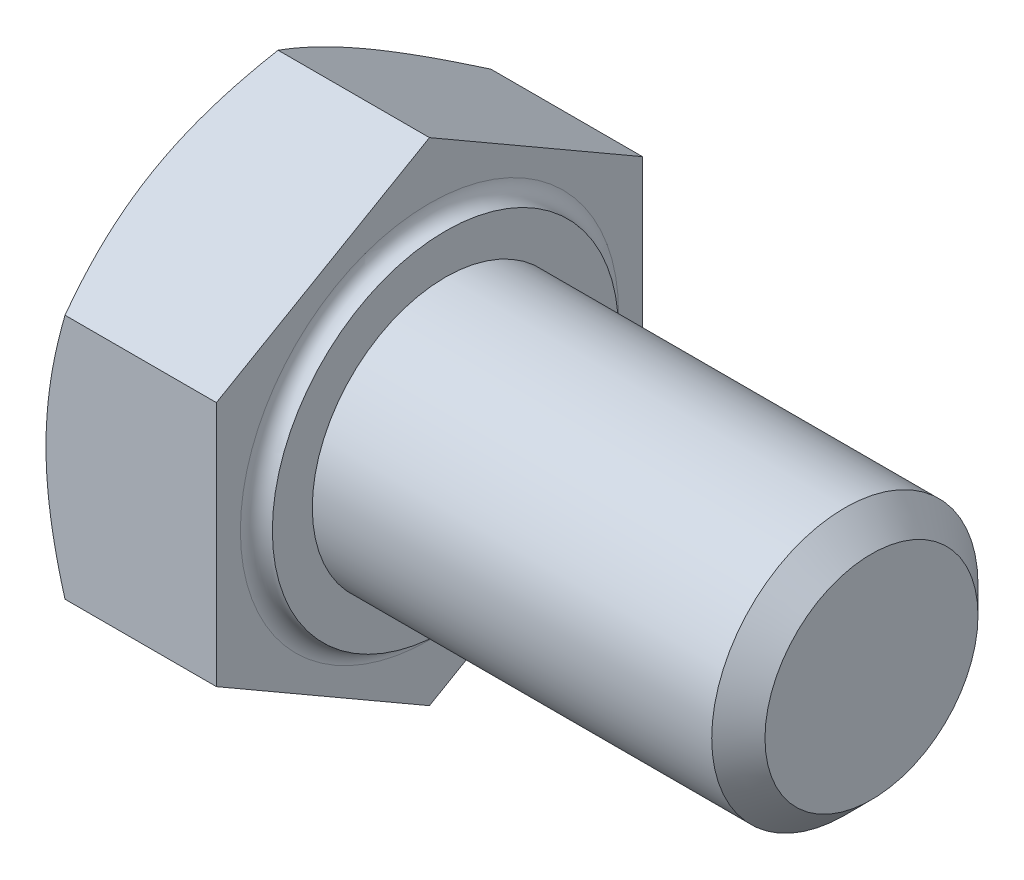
ISO-10303-21;
HEADER;
FILE_DESCRIPTION(('STEP AP214'),'2;1');
FILE_NAME('part.step','',(''),(''),'','','');
FILE_SCHEMA(('AUTOMOTIVE_DESIGN { 1 0 10303 214 1 1 1 1 }'));
ENDSEC;
DATA;
#1=APPLICATION_CONTEXT('core data for automotive mechanical design processes');
#2=APPLICATION_PROTOCOL_DEFINITION('international standard','automotive_design',2000,#1);
#3=PRODUCT_CONTEXT('',#1,'mechanical');
#4=PRODUCT('Part','Part','',(#3));
#5=PRODUCT_RELATED_PRODUCT_CATEGORY('part','',(#4));
#6=PRODUCT_DEFINITION_FORMATION('','',#4);
#7=PRODUCT_DEFINITION_CONTEXT('part definition',#1,'design');
#8=PRODUCT_DEFINITION('design','',#6,#7);
#9=PRODUCT_DEFINITION_SHAPE('','',#8);
#10=(LENGTH_UNIT() NAMED_UNIT(*) SI_UNIT(.MILLI.,.METRE.));
#11=(NAMED_UNIT(*) PLANE_ANGLE_UNIT() SI_UNIT($,.RADIAN.));
#12=(NAMED_UNIT(*) SI_UNIT($,.STERADIAN.) SOLID_ANGLE_UNIT());
#13=UNCERTAINTY_MEASURE_WITH_UNIT(LENGTH_MEASURE(1.E-05),#10,'distance_accuracy_value','');
#14=(GEOMETRIC_REPRESENTATION_CONTEXT(3) GLOBAL_UNCERTAINTY_ASSIGNED_CONTEXT((#13)) GLOBAL_UNIT_ASSIGNED_CONTEXT((#10,
#11,#12)) REPRESENTATION_CONTEXT('',''));
#15=CARTESIAN_POINT('',(0.,0.,0.));
#16=DIRECTION('',(0.,0.,1.));
#17=DIRECTION('',(1.,0.,0.));
#18=AXIS2_PLACEMENT_3D('',#15,#16,#17);
#19=CARTESIAN_POINT('',(-3.5,0.,0.));
#20=DIRECTION('',(-1.,0.,0.));
#21=DIRECTION('',(0.,0.,1.));
#22=AXIS2_PLACEMENT_3D('',#19,#20,#21);
#23=PLANE('',#22);
#24=CARTESIAN_POINT('',(-3.50000000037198,0.,0.));
#25=DIRECTION('',(1.,0.,0.));
#26=DIRECTION('',(0.,0.,-1.));
#27=AXIS2_PLACEMENT_3D('',#24,#25,#26);
#28=CIRCLE('',#27,4.00000000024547);
#29=CARTESIAN_POINT('',(-3.50000000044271,3.46410161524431,2.00000000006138));
#30=VERTEX_POINT('',#29);
#31=CARTESIAN_POINT('',(-3.50000000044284,0.,4.00000000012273));
#32=VERTEX_POINT('',#31);
#33=EDGE_CURVE('E105',#30,#32,#28,.T.);
#34=ORIENTED_EDGE('',*,*,#33,.F.);
#35=CARTESIAN_POINT('',(-3.50000000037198,0.,0.));
#36=DIRECTION('',(1.,0.,0.));
#37=DIRECTION('',(0.,0.,-1.));
#38=AXIS2_PLACEMENT_3D('',#35,#36,#37);
#39=CIRCLE('',#38,4.00000000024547);
#40=CARTESIAN_POINT('',(-3.50000000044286,3.46410161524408,-2.00000000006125));
#41=VERTEX_POINT('',#40);
#42=EDGE_CURVE('E346',#41,#30,#39,.T.);
#43=ORIENTED_EDGE('',*,*,#42,.F.);
#44=CARTESIAN_POINT('',(-3.50000000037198,0.,0.));
#45=DIRECTION('',(1.,0.,0.));
#46=DIRECTION('',(0.,0.,-1.));
#47=AXIS2_PLACEMENT_3D('',#44,#45,#46);
#48=CIRCLE('',#47,4.00000000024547);
#49=CARTESIAN_POINT('',(-3.50000000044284,0.,-4.00000000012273));
#50=VERTEX_POINT('',#49);
#51=EDGE_CURVE('E94',#50,#41,#48,.T.);
#52=ORIENTED_EDGE('',*,*,#51,.F.);
#53=CARTESIAN_POINT('',(-3.50000000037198,0.,0.));
#54=DIRECTION('',(1.,0.,0.));
#55=DIRECTION('',(0.,0.,-1.));
#56=AXIS2_PLACEMENT_3D('',#53,#54,#55);
#57=CIRCLE('',#56,4.00000000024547);
#58=CARTESIAN_POINT('',(-3.50000000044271,-3.46410161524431,-2.00000000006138));
#59=VERTEX_POINT('',#58);
#60=EDGE_CURVE('E89',#59,#50,#57,.T.);
#61=ORIENTED_EDGE('',*,*,#60,.F.);
#62=CARTESIAN_POINT('',(-3.50000000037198,0.,0.));
#63=DIRECTION('',(1.,0.,0.));
#64=DIRECTION('',(0.,0.,-1.));
#65=AXIS2_PLACEMENT_3D('',#62,#63,#64);
#66=CIRCLE('',#65,4.00000000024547);
#67=CARTESIAN_POINT('',(-3.50000000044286,-3.46410161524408,2.00000000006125));
#68=VERTEX_POINT('',#67);
#69=EDGE_CURVE('E87',#68,#59,#66,.T.);
#70=ORIENTED_EDGE('',*,*,#69,.F.);
#71=CARTESIAN_POINT('',(-3.50000000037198,0.,0.));
#72=DIRECTION('',(1.,0.,0.));
#73=DIRECTION('',(0.,0.,-1.));
#74=AXIS2_PLACEMENT_3D('',#71,#72,#73);
#75=CIRCLE('',#74,4.00000000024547);
#76=EDGE_CURVE('E19',#32,#68,#75,.T.);
#77=ORIENTED_EDGE('',*,*,#76,.F.);
#78=EDGE_LOOP('',(#34,#43,#52,#61,#70,#77));
#79=FACE_BOUND('',#78,.T.);
#80=ADVANCED_FACE('F16',(#79),#23,.T.);
#81=CARTESIAN_POINT('',(-3.1405908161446,0.,0.));
#82=DIRECTION('',(1.,0.,0.));
#83=DIRECTION('',(0.,0.,-1.));
#84=AXIS2_PLACEMENT_3D('',#81,#82,#83);
#85=CONICAL_SURFACE('',#84,4.62251496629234,1.04719754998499);
#86=CARTESIAN_POINT('',(-3.14273440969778,-2.30940107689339,3.99999999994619));
#87=CARTESIAN_POINT('',(-3.19701440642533,-2.40339320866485,3.83720085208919));
#88=CARTESIAN_POINT('',(-3.24674436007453,-2.49813806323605,3.6730979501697));
#89=CARTESIAN_POINT('',(-3.3344422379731,-2.68846293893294,3.34344559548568));
#90=CARTESIAN_POINT('',(-3.37246832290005,-2.78403632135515,3.17790764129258));
#91=CARTESIAN_POINT('',(-3.41915789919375,-2.92829837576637,2.92803843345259));
#92=CARTESIAN_POINT('',(-3.43300183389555,-2.97656796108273,2.84443305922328));
#93=CARTESIAN_POINT('',(-3.45696597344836,-3.07333821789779,2.67682205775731));
#94=CARTESIAN_POINT('',(-3.46708627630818,-3.12183888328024,2.59281644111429));
#95=CARTESIAN_POINT('',(-3.48342533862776,-3.21925069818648,2.42409422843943));
#96=CARTESIAN_POINT('',(-3.48962425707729,-3.26816268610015,2.3393761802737));
#97=CARTESIAN_POINT('',(-3.49792016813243,-3.36608285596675,2.16977347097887));
#98=CARTESIAN_POINT('',(-3.5000163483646,-3.4150910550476,2.08488878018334));
#99=CARTESIAN_POINT('',(-3.50000000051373,-3.46410161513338,2.00000000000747));
#100=B_SPLINE_CURVE_WITH_KNOTS('',3,(#86,#87,#88,#89,#90,#91,#92,#93,#94,#95,#96,#97,#98,#99),
.UNSPECIFIED.,.F.,.F.,(4,2,2,2,2,2,4),(0.,0.587229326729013,1.17149154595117,1.46400599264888,
1.7565127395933,2.05048788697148,2.34452123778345),.UNSPECIFIED.);
#101=CARTESIAN_POINT('',(-3.14273440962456,-2.30940107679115,3.99999999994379));
#102=VERTEX_POINT('',#101);
#103=EDGE_CURVE('E100',#102,#68,#100,.T.);
#104=ORIENTED_EDGE('',*,*,#103,.F.);
#105=CARTESIAN_POINT('',(-3.50000000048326,0.,3.99999999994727));
#106=CARTESIAN_POINT('',(-3.50001634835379,-0.0980211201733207,3.99999999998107));
#107=CARTESIAN_POINT('',(-3.49792016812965,-0.196037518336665,3.99999999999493));
#108=CARTESIAN_POINT('',(-3.48962425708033,-0.391877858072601,4.00000000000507));
#109=CARTESIAN_POINT('',(-3.4834253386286,-0.489701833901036,4.00000000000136));
#110=CARTESIAN_POINT('',(-3.46708627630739,-0.684525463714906,3.99999999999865));
#111=CARTESIAN_POINT('',(-3.45696597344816,-0.781526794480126,3.99999999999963));
#112=CARTESIAN_POINT('',(-3.43300183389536,-0.975067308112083,4.00000000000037));
#113=CARTESIAN_POINT('',(-3.41915789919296,-1.07160647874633,4.00000000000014));
#114=CARTESIAN_POINT('',(-3.37246832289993,-1.36013058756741,3.99999999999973));
#115=CARTESIAN_POINT('',(-3.33444223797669,-1.55127735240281,3.99999999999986));
#116=CARTESIAN_POINT('',(-3.24674436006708,-1.93192710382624,4.00000000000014));
#117=CARTESIAN_POINT('',(-3.19701440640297,-2.12141681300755,4.00000000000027));
#118=CARTESIAN_POINT('',(-3.14273440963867,-2.30940107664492,4.));
#119=B_SPLINE_CURVE_WITH_KNOTS('',3,(#105,#106,#107,#108,#109,#110,#111,#112,#113,#114,#115,
#116,#117,#118),.UNSPECIFIED.,.F.,.F.,(4,2,2,2,2,2,4),(0.,0.294033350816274,0.588008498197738,
0.880515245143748,1.1730296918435,1.75729191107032,2.3445212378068),.UNSPECIFIED.);
#120=EDGE_CURVE('E103',#32,#102,#119,.T.);
#121=ORIENTED_EDGE('',*,*,#120,.F.);
#122=ORIENTED_EDGE('',*,*,#76,.T.);
#123=EDGE_LOOP('',(#104,#121,#122));
#124=FACE_BOUND('',#123,.T.);
#125=ADVANCED_FACE('F98',(#124),#85,.T.);
#126=CARTESIAN_POINT('',(-3.1405908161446,0.,0.));
#127=DIRECTION('',(1.,0.,0.));
#128=DIRECTION('',(0.,0.,-1.));
#129=AXIS2_PLACEMENT_3D('',#126,#127,#128);
#130=CONICAL_SURFACE('',#129,4.62251496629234,1.04719754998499);
#131=CARTESIAN_POINT('',(-3.14273440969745,2.3094010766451,4.00000000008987));
#132=CARTESIAN_POINT('',(-3.19701440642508,2.12141681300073,4.00000000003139));
#133=CARTESIAN_POINT('',(-3.24674436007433,1.93192710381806,4.0000000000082));
#134=CARTESIAN_POINT('',(-3.33444223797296,1.55127735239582,3.99999999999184));
#135=CARTESIAN_POINT('',(-3.37246832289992,1.36013058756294,3.9999999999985));
#136=CARTESIAN_POINT('',(-3.41915789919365,1.07160647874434,4.00000000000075));
#137=CARTESIAN_POINT('',(-3.43300183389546,0.975067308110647,4.0000000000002));
#138=CARTESIAN_POINT('',(-3.45696597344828,0.781526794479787,3.9999999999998));
#139=CARTESIAN_POINT('',(-3.46708627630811,0.684525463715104,3.99999999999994));
#140=CARTESIAN_POINT('',(-3.48342533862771,0.489701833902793,4.00000000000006));
#141=CARTESIAN_POINT('',(-3.48962425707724,0.391877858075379,4.00000000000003));
#142=CARTESIAN_POINT('',(-3.49792016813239,0.196037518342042,3.99999999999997));
#143=CARTESIAN_POINT('',(-3.50001634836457,0.0980211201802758,3.99999999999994));
#144=CARTESIAN_POINT('',(-3.5000000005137,8.78869142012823E-12,4.));
#145=B_SPLINE_CURVE_WITH_KNOTS('',3,(#131,#132,#133,#134,#135,#136,#137,#138,#139,#140,#141,
#142,#143,#144),.UNSPECIFIED.,.F.,.F.,(4,2,2,2,2,2,4),(0.,0.58722932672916,1.17149154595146,
1.46400599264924,1.75651273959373,2.05048788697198,2.34452123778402),.UNSPECIFIED.);
#146=CARTESIAN_POINT('',(-3.14273440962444,2.30940107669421,4.));
#147=VERTEX_POINT('',#146);
#148=EDGE_CURVE('E112',#147,#32,#145,.T.);
#149=ORIENTED_EDGE('',*,*,#148,.F.);
#150=CARTESIAN_POINT('',(-3.50000000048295,3.46410161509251,1.99999999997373));
#151=CARTESIAN_POINT('',(-3.5000163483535,3.41509105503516,2.08488878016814));
#152=CARTESIAN_POINT('',(-3.49792016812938,3.36608285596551,2.16977347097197));
#153=CARTESIAN_POINT('',(-3.48962425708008,3.26816268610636,2.3393761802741));
#154=CARTESIAN_POINT('',(-3.48342533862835,3.21925069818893,2.42409422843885));
#155=CARTESIAN_POINT('',(-3.46708627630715,3.12183888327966,2.59281644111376));
#156=CARTESIAN_POINT('',(-3.45696597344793,3.07333821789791,2.67682205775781));
#157=CARTESIAN_POINT('',(-3.43300183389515,2.97656796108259,2.84443305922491));
#158=CARTESIAN_POINT('',(-3.41915789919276,2.92829837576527,2.92803843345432));
#159=CARTESIAN_POINT('',(-3.37246832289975,2.7840363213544,3.17790764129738));
#160=CARTESIAN_POINT('',(-3.33444223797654,2.68846293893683,3.34344559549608));
#161=CARTESIAN_POINT('',(-3.24674436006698,2.49813806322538,3.67309795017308));
#162=CARTESIAN_POINT('',(-3.19701440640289,2.40339320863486,3.83720085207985));
#163=CARTESIAN_POINT('',(-3.14273440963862,2.30940107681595,3.99999999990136));
#164=B_SPLINE_CURVE_WITH_KNOTS('',3,(#150,#151,#152,#153,#154,#155,#156,#157,#158,#159,#160,
#161,#162,#163),.UNSPECIFIED.,.F.,.F.,(4,2,2,2,2,2,4),(0.,0.294033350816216,0.588008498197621,
0.880515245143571,1.17302969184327,1.75729191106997,2.34452123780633),.UNSPECIFIED.);
#165=EDGE_CURVE('E166',#30,#147,#164,.T.);
#166=ORIENTED_EDGE('',*,*,#165,.F.);
#167=ORIENTED_EDGE('',*,*,#33,.T.);
#168=EDGE_LOOP('',(#149,#166,#167));
#169=FACE_BOUND('',#168,.T.);
#170=ADVANCED_FACE('F134',(#169),#130,.T.);
#171=CARTESIAN_POINT('',(-3.1405908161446,0.,0.));
#172=DIRECTION('',(1.,0.,0.));
#173=DIRECTION('',(0.,0.,-1.));
#174=AXIS2_PLACEMENT_3D('',#171,#172,#173);
#175=CONICAL_SURFACE('',#174,4.62251496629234,1.04719754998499);
#176=CARTESIAN_POINT('',(-3.14273440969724,4.61880215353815,1.4379973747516E-10));
#177=CARTESIAN_POINT('',(-3.19701440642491,4.52481002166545,0.162799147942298));
#178=CARTESIAN_POINT('',(-3.24674436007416,4.43006516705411,0.326902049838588));
#179=CARTESIAN_POINT('',(-3.33444223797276,4.23974029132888,0.656554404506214));
#180=CARTESIAN_POINT('',(-3.3724683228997,4.14416690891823,0.822092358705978));
#181=CARTESIAN_POINT('',(-3.4191578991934,3.99990485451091,1.0719615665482));
#182=CARTESIAN_POINT('',(-3.43300183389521,3.9516352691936,1.15556694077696));
#183=CARTESIAN_POINT('',(-3.45696597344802,3.85486501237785,1.32317794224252));
#184=CARTESIAN_POINT('',(-3.46708627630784,3.80636434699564,1.40718355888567));
#185=CARTESIAN_POINT('',(-3.48342533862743,3.70895253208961,1.57590577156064));
#186=CARTESIAN_POINT('',(-3.48962425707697,3.6600405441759,1.66062381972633));
#187=CARTESIAN_POINT('',(-3.49792016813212,3.5621203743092,1.83022652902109));
#188=CARTESIAN_POINT('',(-3.50001634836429,3.51311217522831,1.91511121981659));
#189=CARTESIAN_POINT('',(-3.50000000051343,3.46410161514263,1.99999999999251));
#190=B_SPLINE_CURVE_WITH_KNOTS('',3,(#176,#177,#178,#179,#180,#181,#182,#183,#184,#185,#186,
#187,#188,#189),.UNSPECIFIED.,.F.,.F.,(4,2,2,2,2,2,4),(0.,0.58722932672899,1.17149154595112,
1.46400599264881,1.75651273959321,2.05048788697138,2.34452123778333),.UNSPECIFIED.);
#191=CARTESIAN_POINT('',(-3.14273440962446,4.61880215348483,5.62523670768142E-11));
#192=VERTEX_POINT('',#191);
#193=EDGE_CURVE('E143',#192,#30,#190,.T.);
#194=ORIENTED_EDGE('',*,*,#193,.F.);
#195=CARTESIAN_POINT('',(-3.50000000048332,3.46410161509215,-1.99999999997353));
#196=CARTESIAN_POINT('',(-3.50001634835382,3.51311217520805,-1.91511121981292));
#197=CARTESIAN_POINT('',(-3.49792016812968,3.56212037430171,-1.83022652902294));
#198=CARTESIAN_POINT('',(-3.48962425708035,3.66004054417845,-1.66062381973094));
#199=CARTESIAN_POINT('',(-3.48342533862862,3.70895253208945,-1.57590577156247));
#200=CARTESIAN_POINT('',(-3.46708627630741,3.80636434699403,-1.40718355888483));
#201=CARTESIAN_POINT('',(-3.45696597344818,3.85486501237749,-1.32317794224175));
#202=CARTESIAN_POINT('',(-3.43300183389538,3.9516352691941,-1.15556694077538));
#203=CARTESIAN_POINT('',(-3.41915789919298,3.99990485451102,-1.07196156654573));
#204=CARTESIAN_POINT('',(-3.37246832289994,4.1441669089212,-0.822092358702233));
#205=CARTESIAN_POINT('',(-3.33444223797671,4.23974029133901,-0.656554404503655));
#206=CARTESIAN_POINT('',(-3.2467443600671,4.43006516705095,-0.326902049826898));
#207=CARTESIAN_POINT('',(-3.197014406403,4.52481002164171,-0.16279914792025));
#208=CARTESIAN_POINT('',(-3.1427344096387,4.61880215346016,-9.84525494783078E-11));
#209=B_SPLINE_CURVE_WITH_KNOTS('',3,(#195,#196,#197,#198,#199,#200,#201,#202,#203,#204,#205,
#206,#207,#208),.UNSPECIFIED.,.F.,.F.,(4,2,2,2,2,2,4),(0.,0.294033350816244,0.588008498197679,
0.88051524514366,1.17302969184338,1.75729191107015,2.34452123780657),.UNSPECIFIED.);
#210=EDGE_CURVE('E180',#41,#192,#209,.T.);
#211=ORIENTED_EDGE('',*,*,#210,.F.);
#212=ORIENTED_EDGE('',*,*,#42,.T.);
#213=EDGE_LOOP('',(#194,#211,#212));
#214=FACE_BOUND('',#213,.T.);
#215=ADVANCED_FACE('F188',(#214),#175,.T.);
#216=CARTESIAN_POINT('',(-3.1405908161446,0.,0.));
#217=DIRECTION('',(1.,0.,0.));
#218=DIRECTION('',(0.,0.,-1.));
#219=AXIS2_PLACEMENT_3D('',#216,#217,#218);
#220=CONICAL_SURFACE('',#219,4.62251496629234,1.04719754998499);
#221=CARTESIAN_POINT('',(-3.14273440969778,2.3094010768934,-3.99999999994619));
#222=CARTESIAN_POINT('',(-3.19701440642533,2.40339320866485,-3.83720085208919));
#223=CARTESIAN_POINT('',(-3.24674436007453,2.49813806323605,-3.6730979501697));
#224=CARTESIAN_POINT('',(-3.3344422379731,2.68846293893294,-3.34344559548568));
#225=CARTESIAN_POINT('',(-3.37246832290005,2.78403632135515,-3.17790764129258));
#226=CARTESIAN_POINT('',(-3.41915789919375,2.92829837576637,-2.92803843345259));
#227=CARTESIAN_POINT('',(-3.43300183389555,2.97656796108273,-2.84443305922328));
#228=CARTESIAN_POINT('',(-3.45696597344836,3.07333821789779,-2.67682205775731));
#229=CARTESIAN_POINT('',(-3.46708627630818,3.12183888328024,-2.59281644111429));
#230=CARTESIAN_POINT('',(-3.48342533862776,3.21925069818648,-2.42409422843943));
#231=CARTESIAN_POINT('',(-3.48962425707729,3.26816268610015,-2.3393761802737));
#232=CARTESIAN_POINT('',(-3.49792016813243,3.36608285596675,-2.16977347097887));
#233=CARTESIAN_POINT('',(-3.5000163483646,3.4150910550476,-2.08488878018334));
#234=CARTESIAN_POINT('',(-3.50000000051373,3.46410161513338,-2.00000000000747));
#235=B_SPLINE_CURVE_WITH_KNOTS('',3,(#221,#222,#223,#224,#225,#226,#227,#228,#229,#230,#231,
#232,#233,#234),.UNSPECIFIED.,.F.,.F.,(4,2,2,2,2,2,4),(0.,0.587229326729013,1.17149154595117,
1.46400599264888,1.7565127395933,2.05048788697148,2.34452123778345),.UNSPECIFIED.);
#236=CARTESIAN_POINT('',(-3.14273440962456,2.30940107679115,-3.99999999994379));
#237=VERTEX_POINT('',#236);
#238=EDGE_CURVE('E173',#237,#41,#235,.T.);
#239=ORIENTED_EDGE('',*,*,#238,.F.);
#240=CARTESIAN_POINT('',(-3.50000000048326,0.,-3.99999999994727));
#241=CARTESIAN_POINT('',(-3.50001634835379,0.0980211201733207,-3.99999999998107));
#242=CARTESIAN_POINT('',(-3.49792016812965,0.196037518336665,-3.99999999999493));
#243=CARTESIAN_POINT('',(-3.48962425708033,0.391877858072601,-4.00000000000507));
#244=CARTESIAN_POINT('',(-3.4834253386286,0.489701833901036,-4.00000000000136));
#245=CARTESIAN_POINT('',(-3.46708627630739,0.684525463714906,-3.99999999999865));
#246=CARTESIAN_POINT('',(-3.45696597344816,0.781526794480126,-3.99999999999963));
#247=CARTESIAN_POINT('',(-3.43300183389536,0.975067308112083,-4.00000000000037));
#248=CARTESIAN_POINT('',(-3.41915789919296,1.07160647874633,-4.00000000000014));
#249=CARTESIAN_POINT('',(-3.37246832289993,1.36013058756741,-3.99999999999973));
#250=CARTESIAN_POINT('',(-3.33444223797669,1.55127735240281,-3.99999999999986));
#251=CARTESIAN_POINT('',(-3.24674436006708,1.93192710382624,-4.00000000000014));
#252=CARTESIAN_POINT('',(-3.19701440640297,2.12141681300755,-4.00000000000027));
#253=CARTESIAN_POINT('',(-3.14273440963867,2.30940107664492,-4.));
#254=B_SPLINE_CURVE_WITH_KNOTS('',3,(#240,#241,#242,#243,#244,#245,#246,#247,#248,#249,#250,
#251,#252,#253),.UNSPECIFIED.,.F.,.F.,(4,2,2,2,2,2,4),(0.,0.294033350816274,0.588008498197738,
0.880515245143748,1.1730296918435,1.75729191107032,2.3445212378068),.UNSPECIFIED.);
#255=EDGE_CURVE('E194',#50,#237,#254,.T.);
#256=ORIENTED_EDGE('',*,*,#255,.F.);
#257=ORIENTED_EDGE('',*,*,#51,.T.);
#258=EDGE_LOOP('',(#239,#256,#257));
#259=FACE_BOUND('',#258,.T.);
#260=ADVANCED_FACE('F185',(#259),#220,.T.);
#261=CARTESIAN_POINT('',(-3.1405908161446,0.,0.));
#262=DIRECTION('',(1.,0.,0.));
#263=DIRECTION('',(0.,0.,-1.));
#264=AXIS2_PLACEMENT_3D('',#261,#262,#263);
#265=CONICAL_SURFACE('',#264,4.62251496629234,1.04719754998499);
#266=CARTESIAN_POINT('',(-3.14273440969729,-4.61880215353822,-1.43825530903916E-10));
#267=CARTESIAN_POINT('',(-3.19701440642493,-4.52481002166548,-0.162799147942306));
#268=CARTESIAN_POINT('',(-3.24674436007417,-4.43006516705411,-0.326902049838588));
#269=CARTESIAN_POINT('',(-3.33444223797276,-4.23974029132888,-0.656554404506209));
#270=CARTESIAN_POINT('',(-3.3724683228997,-4.14416690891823,-0.822092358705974));
#271=CARTESIAN_POINT('',(-3.4191578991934,-3.99990485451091,-1.0719615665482));
#272=CARTESIAN_POINT('',(-3.43300183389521,-3.9516352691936,-1.15556694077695));
#273=CARTESIAN_POINT('',(-3.45696597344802,-3.85486501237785,-1.32317794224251));
#274=CARTESIAN_POINT('',(-3.46708627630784,-3.80636434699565,-1.40718355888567));
#275=CARTESIAN_POINT('',(-3.48342533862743,-3.70895253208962,-1.57590577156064));
#276=CARTESIAN_POINT('',(-3.48962425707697,-3.6600405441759,-1.66062381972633));
#277=CARTESIAN_POINT('',(-3.49792016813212,-3.5621203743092,-1.83022652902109));
#278=CARTESIAN_POINT('',(-3.50001634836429,-3.51311217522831,-1.91511121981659));
#279=CARTESIAN_POINT('',(-3.50000000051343,-3.46410161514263,-1.99999999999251));
#280=B_SPLINE_CURVE_WITH_KNOTS('',3,(#266,#267,#268,#269,#270,#271,#272,#273,#274,#275,#276,
#277,#278,#279),.UNSPECIFIED.,.F.,.F.,(4,2,2,2,2,2,4),(0.,0.587229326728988,1.17149154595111,
1.46400599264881,1.75651273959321,2.05048788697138,2.34452123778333),.UNSPECIFIED.);
#281=CARTESIAN_POINT('',(-3.14273440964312,-4.61880215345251,-2.70863802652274E-13));
#282=VERTEX_POINT('',#281);
#283=EDGE_CURVE('E109',#282,#59,#280,.T.);
#284=ORIENTED_EDGE('',*,*,#283,.F.);
#285=CARTESIAN_POINT('',(-3.50000000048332,-3.46410161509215,1.99999999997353));
#286=CARTESIAN_POINT('',(-3.50001634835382,-3.51311217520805,1.91511121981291));
#287=CARTESIAN_POINT('',(-3.49792016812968,-3.56212037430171,1.83022652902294));
#288=CARTESIAN_POINT('',(-3.48962425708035,-3.66004054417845,1.66062381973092));
#289=CARTESIAN_POINT('',(-3.48342533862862,-3.70895253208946,1.57590577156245));
#290=CARTESIAN_POINT('',(-3.46708627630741,-3.80636434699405,1.4071835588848));
#291=CARTESIAN_POINT('',(-3.45696597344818,-3.8548650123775,1.32317794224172));
#292=CARTESIAN_POINT('',(-3.43300183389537,-3.95163526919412,1.15556694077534));
#293=CARTESIAN_POINT('',(-3.41915789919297,-3.99990485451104,1.07196156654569));
#294=CARTESIAN_POINT('',(-3.37246832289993,-4.14416690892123,0.822092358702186));
#295=CARTESIAN_POINT('',(-3.3344422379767,-4.23974029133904,0.6565544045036));
#296=CARTESIAN_POINT('',(-3.24674436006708,-4.43006516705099,0.326902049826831));
#297=CARTESIAN_POINT('',(-3.19701440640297,-4.52481002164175,0.162799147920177));
#298=CARTESIAN_POINT('',(-3.14273440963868,-4.6188021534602,9.83725469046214E-11));
#299=B_SPLINE_CURVE_WITH_KNOTS('',3,(#285,#286,#287,#288,#289,#290,#291,#292,#293,#294,#295,
#296,#297,#298),.UNSPECIFIED.,.F.,.F.,(4,2,2,2,2,2,4),(0.,0.294033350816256,0.588008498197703,
0.880515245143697,1.17302969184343,1.75729191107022,2.34452123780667),.UNSPECIFIED.);
#300=EDGE_CURVE('E106',#68,#282,#299,.T.);
#301=ORIENTED_EDGE('',*,*,#300,.F.);
#302=ORIENTED_EDGE('',*,*,#69,.T.);
#303=EDGE_LOOP('',(#284,#301,#302));
#304=FACE_BOUND('',#303,.T.);
#305=ADVANCED_FACE('F107',(#304),#265,.T.);
#306=CARTESIAN_POINT('',(-3.1405908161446,0.,0.));
#307=DIRECTION('',(1.,0.,0.));
#308=DIRECTION('',(0.,0.,-1.));
#309=AXIS2_PLACEMENT_3D('',#306,#307,#308);
#310=CONICAL_SURFACE('',#309,4.62251496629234,1.04719754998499);
#311=CARTESIAN_POINT('',(-3.14273440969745,-2.3094010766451,-4.00000000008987));
#312=CARTESIAN_POINT('',(-3.19701440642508,-2.12141681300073,-4.00000000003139));
#313=CARTESIAN_POINT('',(-3.24674436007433,-1.93192710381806,-4.0000000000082));
#314=CARTESIAN_POINT('',(-3.33444223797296,-1.55127735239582,-3.99999999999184));
#315=CARTESIAN_POINT('',(-3.37246832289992,-1.36013058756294,-3.9999999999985));
#316=CARTESIAN_POINT('',(-3.41915789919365,-1.07160647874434,-4.00000000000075));
#317=CARTESIAN_POINT('',(-3.43300183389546,-0.975067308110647,-4.0000000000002));
#318=CARTESIAN_POINT('',(-3.45696597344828,-0.781526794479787,-3.9999999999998));
#319=CARTESIAN_POINT('',(-3.46708627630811,-0.684525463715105,-3.99999999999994));
#320=CARTESIAN_POINT('',(-3.48342533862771,-0.489701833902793,-4.00000000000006));
#321=CARTESIAN_POINT('',(-3.48962425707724,-0.391877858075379,-4.00000000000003));
#322=CARTESIAN_POINT('',(-3.49792016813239,-0.196037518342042,-3.99999999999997));
#323=CARTESIAN_POINT('',(-3.50001634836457,-0.0980211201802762,-3.99999999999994));
#324=CARTESIAN_POINT('',(-3.5000000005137,-8.78892628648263E-12,-4.));
#325=B_SPLINE_CURVE_WITH_KNOTS('',3,(#311,#312,#313,#314,#315,#316,#317,#318,#319,#320,#321,
#322,#323,#324),.UNSPECIFIED.,.F.,.F.,(4,2,2,2,2,2,4),(0.,0.58722932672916,1.17149154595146,
1.46400599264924,1.75651273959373,2.05048788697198,2.34452123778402),.UNSPECIFIED.);
#326=CARTESIAN_POINT('',(-3.14273440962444,-2.30940107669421,-4.));
#327=VERTEX_POINT('',#326);
#328=EDGE_CURVE('E201',#327,#50,#325,.T.);
#329=ORIENTED_EDGE('',*,*,#328,.F.);
#330=CARTESIAN_POINT('',(-3.50000000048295,-3.46410161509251,-1.99999999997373));
#331=CARTESIAN_POINT('',(-3.5000163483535,-3.41509105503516,-2.08488878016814));
#332=CARTESIAN_POINT('',(-3.49792016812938,-3.36608285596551,-2.16977347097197));
#333=CARTESIAN_POINT('',(-3.48962425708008,-3.26816268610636,-2.3393761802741));
#334=CARTESIAN_POINT('',(-3.48342533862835,-3.21925069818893,-2.42409422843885));
#335=CARTESIAN_POINT('',(-3.46708627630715,-3.12183888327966,-2.59281644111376));
#336=CARTESIAN_POINT('',(-3.45696597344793,-3.07333821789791,-2.67682205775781));
#337=CARTESIAN_POINT('',(-3.43300183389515,-2.97656796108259,-2.84443305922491));
#338=CARTESIAN_POINT('',(-3.41915789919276,-2.92829837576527,-2.92803843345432));
#339=CARTESIAN_POINT('',(-3.37246832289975,-2.7840363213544,-3.17790764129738));
#340=CARTESIAN_POINT('',(-3.33444223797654,-2.68846293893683,-3.34344559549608));
#341=CARTESIAN_POINT('',(-3.24674436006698,-2.49813806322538,-3.67309795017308));
#342=CARTESIAN_POINT('',(-3.19701440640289,-2.40339320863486,-3.83720085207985));
#343=CARTESIAN_POINT('',(-3.14273440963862,-2.30940107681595,-3.99999999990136));
#344=B_SPLINE_CURVE_WITH_KNOTS('',3,(#330,#331,#332,#333,#334,#335,#336,#337,#338,#339,#340,
#341,#342,#343),.UNSPECIFIED.,.F.,.F.,(4,2,2,2,2,2,4),(0.,0.294033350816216,0.588008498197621,
0.880515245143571,1.17302969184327,1.75729191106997,2.34452123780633),.UNSPECIFIED.);
#345=EDGE_CURVE('E223',#59,#327,#344,.T.);
#346=ORIENTED_EDGE('',*,*,#345,.F.);
#347=ORIENTED_EDGE('',*,*,#60,.T.);
#348=EDGE_LOOP('',(#329,#346,#347));
#349=FACE_BOUND('',#348,.T.);
#350=ADVANCED_FACE('F232',(#349),#310,.T.);
#351=CARTESIAN_POINT('',(0.,-4.618802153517,0.));
#352=DIRECTION('',(0.,-0.866025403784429,0.500000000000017));
#353=DIRECTION('',(0.,-0.500000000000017,-0.866025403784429));
#354=AXIS2_PLACEMENT_3D('',#351,#352,#353);
#355=PLANE('',#354);
#356=ORIENTED_EDGE('',*,*,#300,.T.);
#357=DIRECTION('',(1.,0.,0.));
#358=VECTOR('',#357,1.);
#359=CARTESIAN_POINT('',(0.,-4.61880215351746,-2.62810606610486E-13));
#360=LINE('',#359,#358);
#361=CARTESIAN_POINT('',(-0.3,-4.61880215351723,-1.3162214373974E-13));
#362=VERTEX_POINT('',#361);
#363=EDGE_CURVE('E296',#362,#282,#360,.F.);
#364=ORIENTED_EDGE('',*,*,#363,.F.);
#365=DIRECTION('',(0.,0.499999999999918,0.866025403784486));
#366=VECTOR('',#365,1.);
#367=CARTESIAN_POINT('',(-0.3,-4.618802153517,0.));
#368=LINE('',#367,#366);
#369=CARTESIAN_POINT('',(-0.3,-2.30940107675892,4.));
#370=VERTEX_POINT('',#369);
#371=EDGE_CURVE('E295',#362,#370,#368,.T.);
#372=ORIENTED_EDGE('',*,*,#371,.T.);
#373=DIRECTION('',(1.,0.,0.));
#374=VECTOR('',#373,1.);
#375=CARTESIAN_POINT('',(0.,-2.309401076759,4.));
#376=LINE('',#375,#374);
#377=EDGE_CURVE('E116',#102,#370,#376,.T.);
#378=ORIENTED_EDGE('',*,*,#377,.F.);
#379=ORIENTED_EDGE('',*,*,#103,.T.);
#380=EDGE_LOOP('',(#356,#364,#372,#378,#379));
#381=FACE_BOUND('',#380,.T.);
#382=ADVANCED_FACE('F114',(#381),#355,.T.);
#383=CARTESIAN_POINT('',(0.,-2.309401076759,4.));
#384=DIRECTION('',(0.,0.,1.));
#385=DIRECTION('',(1.,0.,0.));
#386=AXIS2_PLACEMENT_3D('',#383,#384,#385);
#387=PLANE('',#386);
#388=ORIENTED_EDGE('',*,*,#120,.T.);
#389=ORIENTED_EDGE('',*,*,#377,.T.);
#390=DIRECTION('',(0.,1.,0.));
#391=VECTOR('',#390,1.);
#392=CARTESIAN_POINT('',(-0.3,0.,4.));
#393=LINE('',#392,#391);
#394=CARTESIAN_POINT('',(-0.3,2.309401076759,4.));
#395=VERTEX_POINT('',#394);
#396=EDGE_CURVE('E311',#370,#395,#393,.T.);
#397=ORIENTED_EDGE('',*,*,#396,.T.);
#398=DIRECTION('',(1.,0.,0.));
#399=VECTOR('',#398,1.);
#400=CARTESIAN_POINT('',(0.,2.309401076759,4.));
#401=LINE('',#400,#399);
#402=EDGE_CURVE('E172',#147,#395,#401,.T.);
#403=ORIENTED_EDGE('',*,*,#402,.F.);
#404=ORIENTED_EDGE('',*,*,#148,.T.);
#405=EDGE_LOOP('',(#388,#389,#397,#403,#404));
#406=FACE_BOUND('',#405,.T.);
#407=ADVANCED_FACE('F152',(#406),#387,.T.);
#408=CARTESIAN_POINT('',(0.,2.309401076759,4.));
#409=DIRECTION('',(0.,0.866025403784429,0.500000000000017));
#410=DIRECTION('',(0.,-0.500000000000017,0.866025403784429));
#411=AXIS2_PLACEMENT_3D('',#408,#409,#410);
#412=PLANE('',#411);
#413=ORIENTED_EDGE('',*,*,#165,.T.);
#414=ORIENTED_EDGE('',*,*,#402,.T.);
#415=DIRECTION('',(0.,0.499999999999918,-0.866025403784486));
#416=VECTOR('',#415,1.);
#417=CARTESIAN_POINT('',(-0.3,2.309401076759,4.));
#418=LINE('',#417,#416);
#419=CARTESIAN_POINT('',(-0.3,4.61880215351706,0.));
#420=VERTEX_POINT('',#419);
#421=EDGE_CURVE('E313',#395,#420,#418,.T.);
#422=ORIENTED_EDGE('',*,*,#421,.T.);
#423=DIRECTION('',(1.,0.,0.));
#424=VECTOR('',#423,1.);
#425=CARTESIAN_POINT('',(0.,4.618802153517,0.));
#426=LINE('',#425,#424);
#427=EDGE_CURVE('E299',#192,#420,#426,.T.);
#428=ORIENTED_EDGE('',*,*,#427,.F.);
#429=ORIENTED_EDGE('',*,*,#193,.T.);
#430=EDGE_LOOP('',(#413,#414,#422,#428,#429));
#431=FACE_BOUND('',#430,.T.);
#432=ADVANCED_FACE('F155',(#431),#412,.T.);
#433=CARTESIAN_POINT('',(0.,4.618802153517,0.));
#434=DIRECTION('',(0.,0.866025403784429,-0.500000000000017));
#435=DIRECTION('',(0.,0.500000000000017,0.866025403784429));
#436=AXIS2_PLACEMENT_3D('',#433,#434,#435);
#437=PLANE('',#436);
#438=ORIENTED_EDGE('',*,*,#210,.T.);
#439=ORIENTED_EDGE('',*,*,#427,.T.);
#440=DIRECTION('',(0.,-0.499999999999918,-0.866025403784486));
#441=VECTOR('',#440,1.);
#442=CARTESIAN_POINT('',(-0.3,4.618802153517,0.));
#443=LINE('',#442,#441);
#444=CARTESIAN_POINT('',(-0.3,2.30940107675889,-4.));
#445=VERTEX_POINT('',#444);
#446=EDGE_CURVE('E307',#420,#445,#443,.T.);
#447=ORIENTED_EDGE('',*,*,#446,.T.);
#448=DIRECTION('',(-1.,0.,0.));
#449=VECTOR('',#448,1.);
#450=CARTESIAN_POINT('',(0.,2.309401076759,-4.));
#451=LINE('',#450,#449);
#452=EDGE_CURVE('E200',#237,#445,#451,.F.);
#453=ORIENTED_EDGE('',*,*,#452,.F.);
#454=ORIENTED_EDGE('',*,*,#238,.T.);
#455=EDGE_LOOP('',(#438,#439,#447,#453,#454));
#456=FACE_BOUND('',#455,.T.);
#457=ADVANCED_FACE('F161',(#456),#437,.T.);
#458=CARTESIAN_POINT('',(0.,2.309401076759,-4.));
#459=DIRECTION('',(0.,0.,-1.));
#460=DIRECTION('',(-1.,0.,0.));
#461=AXIS2_PLACEMENT_3D('',#458,#459,#460);
#462=PLANE('',#461);
#463=ORIENTED_EDGE('',*,*,#255,.T.);
#464=ORIENTED_EDGE('',*,*,#452,.T.);
#465=DIRECTION('',(0.,1.,0.));
#466=VECTOR('',#465,1.);
#467=CARTESIAN_POINT('',(-0.3,0.,-4.));
#468=LINE('',#467,#466);
#469=CARTESIAN_POINT('',(-0.3,-2.309401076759,-4.));
#470=VERTEX_POINT('',#469);
#471=EDGE_CURVE('E34',#445,#470,#468,.F.);
#472=ORIENTED_EDGE('',*,*,#471,.T.);
#473=DIRECTION('',(1.,0.,0.));
#474=VECTOR('',#473,1.);
#475=CARTESIAN_POINT('',(0.,-2.309401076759,-4.));
#476=LINE('',#475,#474);
#477=EDGE_CURVE('E229',#327,#470,#476,.T.);
#478=ORIENTED_EDGE('',*,*,#477,.F.);
#479=ORIENTED_EDGE('',*,*,#328,.T.);
#480=EDGE_LOOP('',(#463,#464,#472,#478,#479));
#481=FACE_BOUND('',#480,.T.);
#482=ADVANCED_FACE('F210',(#481),#462,.T.);
#483=CARTESIAN_POINT('',(0.,-2.309401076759,-4.));
#484=DIRECTION('',(0.,-0.866025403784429,-0.500000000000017));
#485=DIRECTION('',(0.,0.500000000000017,-0.866025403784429));
#486=AXIS2_PLACEMENT_3D('',#483,#484,#485);
#487=PLANE('',#486);
#488=ORIENTED_EDGE('',*,*,#345,.T.);
#489=ORIENTED_EDGE('',*,*,#477,.T.);
#490=DIRECTION('',(0.,-0.499999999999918,0.866025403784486));
#491=VECTOR('',#490,1.);
#492=CARTESIAN_POINT('',(-0.3,-2.309401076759,-4.));
#493=LINE('',#492,#491);
#494=EDGE_CURVE('E306',#470,#362,#493,.T.);
#495=ORIENTED_EDGE('',*,*,#494,.T.);
#496=ORIENTED_EDGE('',*,*,#363,.T.);
#497=ORIENTED_EDGE('',*,*,#283,.T.);
#498=EDGE_LOOP('',(#488,#489,#495,#496,#497));
#499=FACE_BOUND('',#498,.T.);
#500=ADVANCED_FACE('F213',(#499),#487,.T.);
#501=CARTESIAN_POINT('',(-0.3,0.,0.));
#502=DIRECTION('',(-1.,0.,0.));
#503=DIRECTION('',(0.,0.,1.));
#504=AXIS2_PLACEMENT_3D('',#501,#502,#503);
#505=PLANE('',#504);
#506=CARTESIAN_POINT('',(-0.3,0.,0.));
#507=DIRECTION('',(1.,0.,0.));
#508=DIRECTION('',(0.,0.499999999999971,-0.866025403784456));
#509=AXIS2_PLACEMENT_3D('',#506,#507,#508);
#510=CIRCLE('',#509,3.55000000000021);
#511=CARTESIAN_POINT('',(-0.3,1.775,-3.074390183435));
#512=VERTEX_POINT('',#511);
#513=EDGE_CURVE('E277',#512,#512,#510,.F.);
#514=ORIENTED_EDGE('',*,*,#513,.T.);
#515=EDGE_LOOP('',(#514));
#516=FACE_BOUND('',#515,.T.);
#517=ORIENTED_EDGE('',*,*,#471,.F.);
#518=ORIENTED_EDGE('',*,*,#446,.F.);
#519=ORIENTED_EDGE('',*,*,#421,.F.);
#520=ORIENTED_EDGE('',*,*,#396,.F.);
#521=ORIENTED_EDGE('',*,*,#371,.F.);
#522=ORIENTED_EDGE('',*,*,#494,.F.);
#523=EDGE_LOOP('',(#517,#518,#519,#520,#521,#522));
#524=FACE_BOUND('',#523,.T.);
#525=ADVANCED_FACE('F218',(#516,#524),#505,.F.);
#526=CARTESIAN_POINT('',(0.,0.,0.));
#527=DIRECTION('',(-1.,0.,0.));
#528=DIRECTION('',(0.,0.,1.));
#529=AXIS2_PLACEMENT_3D('',#526,#527,#528);
#530=TOROIDAL_SURFACE('',#529,3.55,0.3);
#531=ORIENTED_EDGE('',*,*,#513,.F.);
#532=EDGE_LOOP('',(#531));
#533=FACE_BOUND('',#532,.T.);
#534=CARTESIAN_POINT('',(0.,0.,0.));
#535=DIRECTION('',(-1.,0.,0.));
#536=DIRECTION('',(0.,0.,1.));
#537=AXIS2_PLACEMENT_3D('',#534,#535,#536);
#538=CIRCLE('',#537,3.25);
#539=CARTESIAN_POINT('',(0.,0.,3.25));
#540=VERTEX_POINT('',#539);
#541=EDGE_CURVE('E230',#540,#540,#538,.T.);
#542=ORIENTED_EDGE('',*,*,#541,.T.);
#543=EDGE_LOOP('',(#542));
#544=FACE_BOUND('',#543,.T.);
#545=ADVANCED_FACE('F262',(#533,#544),#530,.F.);
#546=CARTESIAN_POINT('',(8.,0.,0.));
#547=DIRECTION('',(-1.,0.,0.));
#548=DIRECTION('',(0.,0.,1.));
#549=AXIS2_PLACEMENT_3D('',#546,#547,#548);
#550=PLANE('',#549);
#551=CARTESIAN_POINT('',(8.00000000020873,0.,0.));
#552=DIRECTION('',(-1.,0.,0.));
#553=DIRECTION('',(0.,0.,1.));
#554=AXIS2_PLACEMENT_3D('',#551,#552,#553);
#555=CIRCLE('',#554,2.00000000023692);
#556=CARTESIAN_POINT('',(8.00000000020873,0.,2.00000000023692));
#557=VERTEX_POINT('',#556);
#558=EDGE_CURVE('E317',#557,#557,#555,.T.);
#559=ORIENTED_EDGE('',*,*,#558,.F.);
#560=EDGE_LOOP('',(#559));
#561=FACE_BOUND('',#560,.T.);
#562=ADVANCED_FACE('F259',(#561),#550,.F.);
#563=CARTESIAN_POINT('',(0.,0.,0.));
#564=DIRECTION('',(-1.,0.,0.));
#565=DIRECTION('',(0.,0.,1.));
#566=AXIS2_PLACEMENT_3D('',#563,#564,#565);
#567=PLANE('',#566);
#568=CARTESIAN_POINT('',(0.,0.,0.));
#569=DIRECTION('',(-1.,0.,0.));
#570=DIRECTION('',(0.,0.,1.));
#571=AXIS2_PLACEMENT_3D('',#568,#569,#570);
#572=CIRCLE('',#571,2.5);
#573=CARTESIAN_POINT('',(0.,0.,2.5));
#574=VERTEX_POINT('',#573);
#575=EDGE_CURVE('E25',#574,#574,#572,.F.);
#576=ORIENTED_EDGE('',*,*,#575,.F.);
#577=EDGE_LOOP('',(#576));
#578=FACE_BOUND('',#577,.T.);
#579=ORIENTED_EDGE('',*,*,#541,.F.);
#580=EDGE_LOOP('',(#579));
#581=FACE_BOUND('',#580,.T.);
#582=ADVANCED_FACE('F252',(#578,#581),#567,.F.);
#583=CARTESIAN_POINT('',(7.49999999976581,0.,0.));
#584=DIRECTION('',(-1.,0.,0.));
#585=DIRECTION('',(0.,0.,1.));
#586=AXIS2_PLACEMENT_3D('',#583,#584,#585);
#587=CONICAL_SURFACE('',#586,2.4999999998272,0.785398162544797);
#588=ORIENTED_EDGE('',*,*,#558,.T.);
#589=EDGE_LOOP('',(#588));
#590=FACE_BOUND('',#589,.T.);
#591=CARTESIAN_POINT('',(7.5,0.,0.));
#592=DIRECTION('',(-1.,0.,0.));
#593=DIRECTION('',(0.,0.,1.));
#594=AXIS2_PLACEMENT_3D('',#591,#592,#593);
#595=CIRCLE('',#594,2.5);
#596=CARTESIAN_POINT('',(7.5,0.,2.5));
#597=VERTEX_POINT('',#596);
#598=EDGE_CURVE('E11',#597,#597,#595,.T.);
#599=ORIENTED_EDGE('',*,*,#598,.F.);
#600=EDGE_LOOP('',(#599));
#601=FACE_BOUND('',#600,.T.);
#602=ADVANCED_FACE('F245',(#590,#601),#587,.T.);
#603=CARTESIAN_POINT('',(8.4,0.,0.));
#604=DIRECTION('',(-1.,0.,0.));
#605=DIRECTION('',(0.,0.,1.));
#606=AXIS2_PLACEMENT_3D('',#603,#604,#605);
#607=CYLINDRICAL_SURFACE('',#606,2.5);
#608=ORIENTED_EDGE('',*,*,#598,.T.);
#609=EDGE_LOOP('',(#608));
#610=FACE_BOUND('',#609,.T.);
#611=ORIENTED_EDGE('',*,*,#575,.T.);
#612=EDGE_LOOP('',(#611));
#613=FACE_BOUND('',#612,.T.);
#614=ADVANCED_FACE('F243',(#610,#613),#607,.T.);
#615=CLOSED_SHELL('',(#80,#125,#170,#215,#260,#305,#350,#382,#407,#432,#457,#482,#500,#525,#545,
#562,#582,#602,#614));
#616=MANIFOLD_SOLID_BREP('B1',#615);
#617=ADVANCED_BREP_SHAPE_REPRESENTATION('',(#18,#616),#14);
#618=SHAPE_DEFINITION_REPRESENTATION(#9,#617);
ENDSEC;
END-ISO-10303-21;
